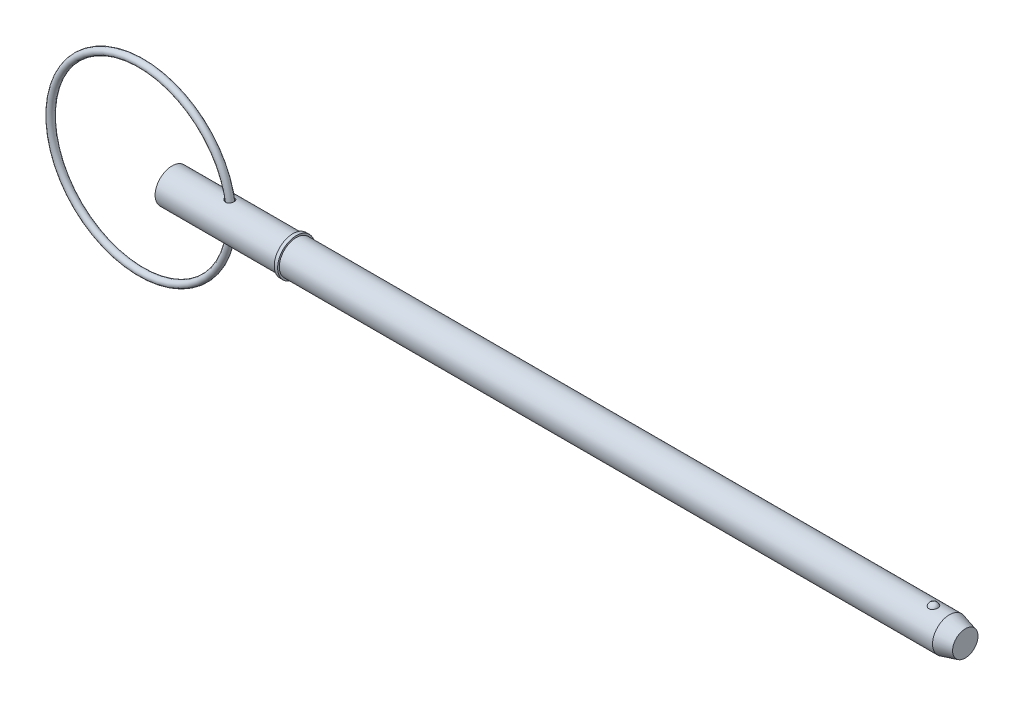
ISO-10303-21;
HEADER;
FILE_DESCRIPTION(('STEP AP214'),'2;1');
FILE_NAME('part.step','',(''),(''),'','','');
FILE_SCHEMA(('AUTOMOTIVE_DESIGN { 1 0 10303 214 1 1 1 1 }'));
ENDSEC;
DATA;
#1=APPLICATION_CONTEXT('core data for automotive mechanical design processes');
#2=APPLICATION_PROTOCOL_DEFINITION('international standard','automotive_design',2000,#1);
#3=PRODUCT_CONTEXT('',#1,'mechanical');
#4=PRODUCT('Part','Part','',(#3));
#5=PRODUCT_RELATED_PRODUCT_CATEGORY('part','',(#4));
#6=PRODUCT_DEFINITION_FORMATION('','',#4);
#7=PRODUCT_DEFINITION_CONTEXT('part definition',#1,'design');
#8=PRODUCT_DEFINITION('design','',#6,#7);
#9=PRODUCT_DEFINITION_SHAPE('','',#8);
#10=(LENGTH_UNIT() NAMED_UNIT(*) SI_UNIT(.MILLI.,.METRE.));
#11=(NAMED_UNIT(*) PLANE_ANGLE_UNIT() SI_UNIT($,.RADIAN.));
#12=(NAMED_UNIT(*) SI_UNIT($,.STERADIAN.) SOLID_ANGLE_UNIT());
#13=UNCERTAINTY_MEASURE_WITH_UNIT(LENGTH_MEASURE(1.E-05),#10,'distance_accuracy_value','');
#14=(GEOMETRIC_REPRESENTATION_CONTEXT(3) GLOBAL_UNCERTAINTY_ASSIGNED_CONTEXT((#13)) GLOBAL_UNIT_ASSIGNED_CONTEXT((#10,
#11,#12)) REPRESENTATION_CONTEXT('',''));
#15=CARTESIAN_POINT('',(0.,0.,0.));
#16=DIRECTION('',(0.,0.,1.));
#17=DIRECTION('',(1.,0.,0.));
#18=AXIS2_PLACEMENT_3D('',#15,#16,#17);
#19=CARTESIAN_POINT('',(-4.3552379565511,0.,0.));
#20=DIRECTION('',(0.,0.,1.));
#21=DIRECTION('',(1.,0.,0.));
#22=AXIS2_PLACEMENT_3D('',#19,#20,#21);
#23=TOROIDAL_SURFACE('',#22,12.7,0.476000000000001);
#24=CARTESIAN_POINT('',(8.8207620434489,0.,0.));
#25=VERTEX_POINT('',#24);
#26=VERTEX_LOOP('',#25);
#27=FACE_BOUND('',#26,.T.);
#28=ADVANCED_FACE('P0_F12',(#27),#23,.T.);
#29=CLOSED_SHELL('',(#28));
#30=MANIFOLD_SOLID_BREP('P0_B1',#29);
#31=CARTESIAN_POINT('',(0.,0.,0.));
#32=DIRECTION('',(1.,0.,0.));
#33=DIRECTION('',(0.,0.,-1.));
#34=AXIS2_PLACEMENT_3D('',#31,#32,#33);
#35=CYLINDRICAL_SURFACE('',#34,2.38);
#36=CARTESIAN_POINT('',(7.65248265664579,2.35074198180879,-0.372037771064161));
#37=CARTESIAN_POINT('',(7.67546616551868,2.34644965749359,-0.399158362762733));
#38=CARTESIAN_POINT('',(7.70081651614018,2.34199234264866,-0.424274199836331));
#39=CARTESIAN_POINT('',(7.75542747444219,2.33326580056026,-0.46990771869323));
#40=CARTESIAN_POINT('',(7.78469342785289,2.32899684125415,-0.49041900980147));
#41=CARTESIAN_POINT('',(7.8462833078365,2.32114904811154,-0.526312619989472));
#42=CARTESIAN_POINT('',(7.87860537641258,2.31756979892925,-0.541698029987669));
#43=CARTESIAN_POINT('',(7.9454452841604,2.31153734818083,-0.566889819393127));
#44=CARTESIAN_POINT('',(7.97996214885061,2.30908365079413,-0.576698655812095));
#45=CARTESIAN_POINT('',(8.05000735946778,2.30564492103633,-0.590297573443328));
#46=CARTESIAN_POINT('',(8.0855275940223,2.30465036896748,-0.594126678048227));
#47=CARTESIAN_POINT('',(8.15670718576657,2.30426876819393,-0.595606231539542));
#48=CARTESIAN_POINT('',(8.1923664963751,2.30488122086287,-0.593258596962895));
#49=CARTESIAN_POINT('',(8.26077822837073,2.30759475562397,-0.582609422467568));
#50=CARTESIAN_POINT('',(8.29358437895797,2.30961492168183,-0.574631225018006));
#51=CARTESIAN_POINT('',(8.35727060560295,2.31483318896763,-0.553233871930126));
#52=CARTESIAN_POINT('',(8.38815097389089,2.31803111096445,-0.53981554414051));
#53=CARTESIAN_POINT('',(8.44618254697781,2.3251225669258,-0.508384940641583));
#54=CARTESIAN_POINT('',(8.47341743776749,2.32899254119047,-0.490521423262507));
#55=CARTESIAN_POINT('',(8.5244826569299,2.33706025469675,-0.450515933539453));
#56=CARTESIAN_POINT('',(8.54831285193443,2.34125800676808,-0.428373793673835));
#57=CARTESIAN_POINT('',(8.5921621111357,2.34956202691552,-0.38020980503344));
#58=CARTESIAN_POINT('',(8.61214543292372,2.35366715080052,-0.354155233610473));
#59=CARTESIAN_POINT('',(8.64754725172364,2.36130301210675,-0.299034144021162));
#60=CARTESIAN_POINT('',(8.66296545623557,2.36483371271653,-0.269967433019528));
#61=CARTESIAN_POINT('',(8.68903776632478,2.37098548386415,-0.209215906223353));
#62=CARTESIAN_POINT('',(8.69962580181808,2.37359383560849,-0.177501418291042));
#63=CARTESIAN_POINT('',(8.71546966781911,2.37755210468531,-0.112692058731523));
#64=CARTESIAN_POINT('',(8.72072552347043,2.37890202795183,-0.0795971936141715));
#65=CARTESIAN_POINT('',(8.72577448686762,2.38019811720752,-0.0129544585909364));
#66=CARTESIAN_POINT('',(8.72556573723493,2.38014380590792,0.0205935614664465));
#67=CARTESIAN_POINT('',(8.71968604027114,2.37863606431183,0.0871753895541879));
#68=CARTESIAN_POINT('',(8.71401506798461,2.37718262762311,0.120209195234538));
#69=CARTESIAN_POINT('',(8.69736472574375,2.37303648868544,0.184779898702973));
#70=CARTESIAN_POINT('',(8.68639268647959,2.37034549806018,0.216318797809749));
#71=CARTESIAN_POINT('',(8.65941400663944,2.36401552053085,0.277063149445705));
#72=CARTESIAN_POINT('',(8.6434071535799,2.36037649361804,0.306268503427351));
#73=CARTESIAN_POINT('',(8.60670627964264,2.35253749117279,0.361595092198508));
#74=CARTESIAN_POINT('',(8.58600040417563,2.34833610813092,0.387708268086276));
#75=CARTESIAN_POINT('',(8.54044852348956,2.33984863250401,0.436017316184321));
#76=CARTESIAN_POINT('',(8.51560272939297,2.33556254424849,0.458213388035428));
#77=CARTESIAN_POINT('',(8.46260111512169,2.32742099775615,0.497916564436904));
#78=CARTESIAN_POINT('',(8.43446763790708,2.32356294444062,0.51545294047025));
#79=CARTESIAN_POINT('',(8.37555109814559,2.31668866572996,0.545520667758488));
#80=CARTESIAN_POINT('',(8.34476845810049,2.31367230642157,0.558052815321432));
#81=CARTESIAN_POINT('',(8.28194930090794,2.30886128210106,0.57763341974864));
#82=CARTESIAN_POINT('',(8.24993988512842,2.30704826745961,0.584764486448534));
#83=CARTESIAN_POINT('',(8.18514558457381,2.30475365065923,0.593744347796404));
#84=CARTESIAN_POINT('',(8.15236068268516,2.30427207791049,0.595593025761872));
#85=CARTESIAN_POINT('',(8.08670515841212,2.30466513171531,0.594069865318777));
#86=CARTESIAN_POINT('',(8.05383545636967,2.30554895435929,0.590662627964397));
#87=CARTESIAN_POINT('',(7.98908593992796,2.30856010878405,0.578780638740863));
#88=CARTESIAN_POINT('',(7.95720636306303,2.31068773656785,0.570304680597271));
#89=CARTESIAN_POINT('',(7.89377258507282,2.31605973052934,0.54809064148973));
#90=CARTESIAN_POINT('',(7.86230095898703,2.31935100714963,0.534128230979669));
#91=CARTESIAN_POINT('',(7.80205133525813,2.32664713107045,0.501391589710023));
#92=CARTESIAN_POINT('',(7.77327429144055,2.33065222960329,0.48261566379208));
#93=CARTESIAN_POINT('',(7.7179634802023,2.3391254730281,0.439760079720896));
#94=CARTESIAN_POINT('',(7.69158313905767,2.3436062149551,0.415484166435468));
#95=CARTESIAN_POINT('',(7.64339516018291,2.35235146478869,0.362706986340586));
#96=CARTESIAN_POINT('',(7.62158727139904,2.35661598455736,0.334205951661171));
#97=CARTESIAN_POINT('',(7.58382605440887,2.36432007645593,0.274368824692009));
#98=CARTESIAN_POINT('',(7.56774982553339,2.36777633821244,0.243112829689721));
#99=CARTESIAN_POINT('',(7.54152169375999,2.3735493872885,0.178112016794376));
#100=CARTESIAN_POINT('',(7.53136536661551,2.3758670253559,0.14436907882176));
#101=CARTESIAN_POINT('',(7.51809691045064,2.37891982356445,0.0783638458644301));
#102=CARTESIAN_POINT('',(7.5144720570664,2.37976992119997,0.0462095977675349));
#103=CARTESIAN_POINT('',(7.51285288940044,2.38014795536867,-0.0182487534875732));
#104=CARTESIAN_POINT('',(7.5148575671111,2.37967612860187,-0.0505528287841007));
#105=CARTESIAN_POINT('',(7.52413867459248,2.37752661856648,-0.112617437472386));
#106=CARTESIAN_POINT('',(7.53113538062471,2.37591295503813,-0.14242285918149));
#107=CARTESIAN_POINT('',(7.5497775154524,2.37172196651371,-0.200451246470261));
#108=CARTESIAN_POINT('',(7.56142049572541,2.3691451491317,-0.228675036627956));
#109=CARTESIAN_POINT('',(7.58571901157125,2.36396321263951,-0.276620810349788));
#110=CARTESIAN_POINT('',(7.59751818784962,2.36150235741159,-0.296799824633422));
#111=CARTESIAN_POINT('',(7.62336661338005,2.35629864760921,-0.33561908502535));
#112=CARTESIAN_POINT('',(7.63741608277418,2.353555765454,-0.354259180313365));
#113=CARTESIAN_POINT('',(7.65248265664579,2.35074198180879,-0.372037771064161));
#114=B_SPLINE_CURVE_WITH_KNOTS('',3,(#36,#37,#38,#39,#40,#41,#42,#43,#44,#45,#46,#47,#48,#49,
#50,#51,#52,#53,#54,#55,#56,#57,#58,#59,#60,#61,#62,#63,#64,#65,#66,#67,#68,#69,#70,#71,#72,#73,
#74,#75,#76,#77,#78,#79,#80,#81,#82,#83,#84,#85,#86,#87,#88,#89,#90,#91,#92,#93,#94,#95,#96,#97,
#98,#99,#100,#101,#102,#103,#104,#105,#106,#107,#108,#109,#110,#111,#112,#113),.UNSPECIFIED.,
.T.,.F.,(4,2,2,2,2,2,2,2,2,2,2,2,2,2,2,2,2,2,2,2,2,2,2,2,2,2,2,2,2,2,2,2,2,2,2,2,2,2,4),(0.,
0.107335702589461,0.214819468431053,0.322238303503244,0.429609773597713,0.536277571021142,
0.642912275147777,0.743874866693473,0.844822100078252,0.942762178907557,1.04070609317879,
1.1395202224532,1.23834068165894,1.33847507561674,1.43860899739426,1.53877695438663,
1.63894536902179,1.73897565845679,1.83901017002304,1.93929990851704,2.03958453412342,
2.13922343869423,2.23884648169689,2.33691317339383,2.4349820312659,2.53371427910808,
2.63247003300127,2.73577311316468,2.83911262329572,2.94697761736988,3.05483668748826,
3.16021984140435,3.26552413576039,3.36212700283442,3.45871257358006,3.55027266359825,
3.64178456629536,3.71214035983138,3.78250304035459),.UNSPECIFIED.);
#115=CARTESIAN_POINT('',(7.65248265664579,2.35074198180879,-0.372037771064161));
#116=VERTEX_POINT('',#115);
#117=EDGE_CURVE('P1_E42',#116,#116,#114,.T.);
#118=ORIENTED_EDGE('',*,*,#117,.T.);
#119=EDGE_LOOP('',(#118));
#120=FACE_BOUND('',#119,.T.);
#121=CARTESIAN_POINT('',(0.,0.,0.));
#122=DIRECTION('',(1.,0.,0.));
#123=DIRECTION('',(0.,0.,-1.));
#124=AXIS2_PLACEMENT_3D('',#121,#122,#123);
#125=CIRCLE('',#124,2.38);
#126=CARTESIAN_POINT('',(0.,0.,-2.38));
#127=VERTEX_POINT('',#126);
#128=EDGE_CURVE('P1_E9',#127,#127,#125,.T.);
#129=ORIENTED_EDGE('',*,*,#128,.T.);
#130=EDGE_LOOP('',(#129));
#131=FACE_BOUND('',#130,.T.);
#132=CARTESIAN_POINT('',(16.974,0.,0.));
#133=DIRECTION('',(1.,0.,0.));
#134=DIRECTION('',(0.,0.,-1.));
#135=AXIS2_PLACEMENT_3D('',#132,#133,#134);
#136=CIRCLE('',#135,2.38);
#137=CARTESIAN_POINT('',(16.974,0.,-2.38));
#138=VERTEX_POINT('',#137);
#139=EDGE_CURVE('P1_E25',#138,#138,#136,.T.);
#140=ORIENTED_EDGE('',*,*,#139,.F.);
#141=EDGE_LOOP('',(#140));
#142=FACE_BOUND('',#141,.T.);
#143=CARTESIAN_POINT('',(7.65248265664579,-2.35074198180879,-0.372037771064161));
#144=CARTESIAN_POINT('',(7.63152023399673,-2.35465684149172,-0.347300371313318));
#145=CARTESIAN_POINT('',(7.61251328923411,-2.35843676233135,-0.320880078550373));
#146=CARTESIAN_POINT('',(7.57904107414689,-2.36534227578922,-0.265218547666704));
#147=CARTESIAN_POINT('',(7.56457485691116,-2.36846800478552,-0.235977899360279));
#148=CARTESIAN_POINT('',(7.54072865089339,-2.37373250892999,-0.175281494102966));
#149=CARTESIAN_POINT('',(7.53136565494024,-2.37586798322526,-0.143818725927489));
#150=CARTESIAN_POINT('',(7.51825775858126,-2.37888184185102,-0.0796854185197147));
#151=CARTESIAN_POINT('',(7.51451093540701,-2.37976065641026,-0.0470152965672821));
#152=CARTESIAN_POINT('',(7.51287230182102,-2.38014359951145,0.0167788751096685));
#153=CARTESIAN_POINT('',(7.51468714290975,-2.37971660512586,0.0478953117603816));
#154=CARTESIAN_POINT('',(7.52344977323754,-2.37768530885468,0.109352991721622));
#155=CARTESIAN_POINT('',(7.53039746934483,-2.37608102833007,0.139694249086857));
#156=CARTESIAN_POINT('',(7.54900783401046,-2.37189301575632,0.198451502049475));
#157=CARTESIAN_POINT('',(7.56061918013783,-2.36931996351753,0.226884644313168));
#158=CARTESIAN_POINT('',(7.58810377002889,-2.36345094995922,0.281524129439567));
#159=CARTESIAN_POINT('',(7.60397804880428,-2.36015481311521,0.307729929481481));
#160=CARTESIAN_POINT('',(7.64062367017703,-2.35291979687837,0.359001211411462));
#161=CARTESIAN_POINT('',(7.66164499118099,-2.34895316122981,0.383883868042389));
#162=CARTESIAN_POINT('',(7.70730875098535,-2.34094029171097,0.430056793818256));
#163=CARTESIAN_POINT('',(7.73195270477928,-2.33689402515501,0.451345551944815));
#164=CARTESIAN_POINT('',(7.78628123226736,-2.32880869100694,0.491427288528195));
#165=CARTESIAN_POINT('',(7.81620889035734,-2.32479472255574,0.509896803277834));
#166=CARTESIAN_POINT('',(7.87876464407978,-2.31758417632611,0.541729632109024));
#167=CARTESIAN_POINT('',(7.91139323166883,-2.31438774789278,0.55509201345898));
#168=CARTESIAN_POINT('',(7.97916670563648,-2.30915137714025,0.576493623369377));
#169=CARTESIAN_POINT('',(8.0143485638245,-2.30713552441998,0.584422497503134));
#170=CARTESIAN_POINT('',(8.08560438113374,-2.30465258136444,0.594140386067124));
#171=CARTESIAN_POINT('',(8.12167802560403,-2.30418495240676,0.595931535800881));
#172=CARTESIAN_POINT('',(8.19193481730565,-2.30488473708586,0.59321801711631));
#173=CARTESIAN_POINT('',(8.2261295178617,-2.30597897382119,0.588995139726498));
#174=CARTESIAN_POINT('',(8.29321509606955,-2.30956729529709,0.574762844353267));
#175=CARTESIAN_POINT('',(8.32610629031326,-2.31206103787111,0.564754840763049));
#176=CARTESIAN_POINT('',(8.38816900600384,-2.31802118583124,0.539753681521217));
#177=CARTESIAN_POINT('',(8.41743993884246,-2.32144077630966,0.52499526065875));
#178=CARTESIAN_POINT('',(8.47302365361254,-2.32890801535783,0.490807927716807));
#179=CARTESIAN_POINT('',(8.49933643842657,-2.33295566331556,0.471379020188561));
#180=CARTESIAN_POINT('',(8.54827790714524,-2.3412242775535,0.428422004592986));
#181=CARTESIAN_POINT('',(8.57091094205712,-2.34544503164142,0.40489880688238));
#182=CARTESIAN_POINT('',(8.61197038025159,-2.35360640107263,0.354387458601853));
#183=CARTESIAN_POINT('',(8.63039647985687,-2.35754699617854,0.32739905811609));
#184=CARTESIAN_POINT('',(8.66284943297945,-2.36478461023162,0.270249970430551));
#185=CARTESIAN_POINT('',(8.67680333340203,-2.36807065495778,0.240046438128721));
#186=CARTESIAN_POINT('',(8.69957181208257,-2.37356560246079,0.177668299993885));
#187=CARTESIAN_POINT('',(8.70838630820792,-2.37577448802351,0.14549366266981));
#188=CARTESIAN_POINT('',(8.72068442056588,-2.37888446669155,0.0799353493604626));
#189=CARTESIAN_POINT('',(8.72414498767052,-2.37977990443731,0.046547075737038));
#190=CARTESIAN_POINT('',(8.72557509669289,-2.38014803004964,-0.0203543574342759));
#191=CARTESIAN_POINT('',(8.72354468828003,-2.37962073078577,-0.0538675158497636));
#192=CARTESIAN_POINT('',(8.71405606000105,-2.37720346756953,-0.119981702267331));
#193=CARTESIAN_POINT('',(8.70661109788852,-2.37531683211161,-0.152584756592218));
#194=CARTESIAN_POINT('',(8.68649336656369,-2.37038779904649,-0.216044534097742));
#195=CARTESIAN_POINT('',(8.67382040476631,-2.36734535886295,-0.24690119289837));
#196=CARTESIAN_POINT('',(8.64352750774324,-2.36042700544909,-0.306062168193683));
#197=CARTESIAN_POINT('',(8.62589743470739,-2.35654938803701,-0.334361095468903));
#198=CARTESIAN_POINT('',(8.58613860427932,-2.34839114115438,-0.387535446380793));
#199=CARTESIAN_POINT('',(8.5640098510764,-2.34411051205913,-0.412410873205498));
#200=CARTESIAN_POINT('',(8.51586484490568,-2.33563475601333,-0.457982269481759));
#201=CARTESIAN_POINT('',(8.48985596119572,-2.33143948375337,-0.478685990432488));
#202=CARTESIAN_POINT('',(8.43462330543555,-2.32360655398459,-0.515369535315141));
#203=CARTESIAN_POINT('',(8.40540000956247,-2.31996881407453,-0.531350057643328));
#204=CARTESIAN_POINT('',(8.34502624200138,-2.31371771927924,-0.557938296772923));
#205=CARTESIAN_POINT('',(8.31391082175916,-2.31108995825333,-0.568622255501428));
#206=CARTESIAN_POINT('',(8.25027207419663,-2.30707117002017,-0.584715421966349));
#207=CARTESIAN_POINT('',(8.21774884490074,-2.30568005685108,-0.590124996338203));
#208=CARTESIAN_POINT('',(8.15238918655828,-2.30427145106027,-0.595601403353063));
#209=CARTESIAN_POINT('',(8.11955499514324,-2.3042474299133,-0.595693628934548));
#210=CARTESIAN_POINT('',(8.05430726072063,-2.30552664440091,-0.590722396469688));
#211=CARTESIAN_POINT('',(8.02189380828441,-2.3068301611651,-0.585657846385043));
#212=CARTESIAN_POINT('',(7.95720150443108,-2.31066076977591,-0.570360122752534));
#213=CARTESIAN_POINT('',(7.92496602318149,-2.31322859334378,-0.55995436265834));
#214=CARTESIAN_POINT('',(7.86260707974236,-2.31930140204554,-0.534242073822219));
#215=CARTESIAN_POINT('',(7.83248403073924,-2.32280656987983,-0.518934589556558));
#216=CARTESIAN_POINT('',(7.77533132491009,-2.33034138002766,-0.483968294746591));
#217=CARTESIAN_POINT('',(7.74827623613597,-2.33436601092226,-0.464349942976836));
#218=CARTESIAN_POINT('',(7.69762060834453,-2.34255524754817,-0.4210920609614));
#219=CARTESIAN_POINT('',(7.67401956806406,-2.34671983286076,-0.397453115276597));
#220=CARTESIAN_POINT('',(7.65248265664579,-2.35074198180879,-0.372037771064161));
#221=B_SPLINE_CURVE_WITH_KNOTS('',3,(#143,#144,#145,#146,#147,#148,#149,#150,#151,#152,#153,
#154,#155,#156,#157,#158,#159,#160,#161,#162,#163,#164,#165,#166,#167,#168,#169,#170,#171,#172,
#173,#174,#175,#176,#177,#178,#179,#180,#181,#182,#183,#184,#185,#186,#187,#188,#189,#190,#191,
#192,#193,#194,#195,#196,#197,#198,#199,#200,#201,#202,#203,#204,#205,#206,#207,#208,#209,#210,
#211,#212,#213,#214,#215,#216,#217,#218,#219,#220),.UNSPECIFIED.,.T.,.F.,(4,2,2,2,2,2,2,2,2,2,2,
2,2,2,2,2,2,2,2,2,2,2,2,2,2,2,2,2,2,2,2,2,2,2,2,2,2,2,4),(0.,0.0978755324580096,
0.19573064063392,0.293909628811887,0.39205499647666,0.48511441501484,0.578172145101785,
0.670232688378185,0.762315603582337,0.860342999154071,0.958411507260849,1.06411708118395,
1.16984195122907,1.27765506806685,1.38543067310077,1.48831936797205,1.59118291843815,
1.68959047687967,1.78799793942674,1.88628818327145,1.98458551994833,2.08441314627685,
2.18424236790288,2.28450017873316,2.38475708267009,2.48476932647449,2.58478525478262,
2.68500723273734,2.78522911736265,2.88526302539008,2.98528213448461,3.08381637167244,
3.18234375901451,3.28040059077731,3.37847819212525,3.4799455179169,3.58143263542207,
3.68200512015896,3.78256299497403),.UNSPECIFIED.);
#222=CARTESIAN_POINT('',(7.65248265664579,-2.35074198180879,-0.372037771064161));
#223=VERTEX_POINT('',#222);
#224=EDGE_CURVE('P1_E17',#223,#223,#221,.T.);
#225=ORIENTED_EDGE('',*,*,#224,.T.);
#226=EDGE_LOOP('',(#225));
#227=FACE_BOUND('',#226,.T.);
#228=ADVANCED_FACE('P1_F13',(#120,#131,#142,#227),#35,.T.);
#229=CARTESIAN_POINT('',(0.,0.,0.));
#230=DIRECTION('',(1.,0.,0.));
#231=DIRECTION('',(0.,0.,-1.));
#232=AXIS2_PLACEMENT_3D('',#229,#230,#231);
#233=CYLINDRICAL_SURFACE('',#232,2.38);
#234=CARTESIAN_POINT('',(109.209429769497,0.,0.));
#235=DIRECTION('',(1.,0.,0.));
#236=DIRECTION('',(0.,0.,-1.));
#237=AXIS2_PLACEMENT_3D('',#234,#235,#236);
#238=CIRCLE('',#237,2.38);
#239=CARTESIAN_POINT('',(109.209429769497,0.,-2.38));
#240=VERTEX_POINT('',#239);
#241=EDGE_CURVE('P1_E99',#240,#240,#238,.T.);
#242=ORIENTED_EDGE('',*,*,#241,.F.);
#243=EDGE_LOOP('',(#242));
#244=FACE_BOUND('',#243,.T.);
#245=CARTESIAN_POINT('',(17.45,0.,0.));
#246=DIRECTION('',(1.,0.,0.));
#247=DIRECTION('',(0.,0.,-1.));
#248=AXIS2_PLACEMENT_3D('',#245,#246,#247);
#249=CIRCLE('',#248,2.38);
#250=CARTESIAN_POINT('',(17.45,0.,-2.38));
#251=VERTEX_POINT('',#250);
#252=EDGE_CURVE('P1_E96',#251,#251,#249,.T.);
#253=ORIENTED_EDGE('',*,*,#252,.T.);
#254=EDGE_LOOP('',(#253));
#255=FACE_BOUND('',#254,.T.);
#256=CARTESIAN_POINT('',(106.963449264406,2.29215686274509,0.640637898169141));
#257=CARTESIAN_POINT('',(106.930355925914,2.29215737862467,0.640637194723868));
#258=CARTESIAN_POINT('',(106.897254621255,2.29293179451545,0.63788468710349));
#259=CARTESIAN_POINT('',(106.832017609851,2.29594030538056,0.626968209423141));
#260=CARTESIAN_POINT('',(106.799882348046,2.29817506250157,0.6188017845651));
#261=CARTESIAN_POINT('',(106.737540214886,2.30384308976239,0.597351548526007));
#262=CARTESIAN_POINT('',(106.70733051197,2.30727454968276,0.584075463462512));
#263=CARTESIAN_POINT('',(106.649567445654,2.31495941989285,0.552829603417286));
#264=CARTESIAN_POINT('',(106.62201418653,2.31921286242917,0.534859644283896));
#265=CARTESIAN_POINT('',(106.569593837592,2.3282021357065,0.494282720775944));
#266=CARTESIAN_POINT('',(106.544805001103,2.33294694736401,0.471576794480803));
#267=CARTESIAN_POINT('',(106.499216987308,2.34234144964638,0.422446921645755));
#268=CARTESIAN_POINT('',(106.478418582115,2.34699112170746,0.396022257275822));
#269=CARTESIAN_POINT('',(106.44035804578,2.3559394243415,0.338855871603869));
#270=CARTESIAN_POINT('',(106.423305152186,2.36021170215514,0.307970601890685));
#271=CARTESIAN_POINT('',(106.3943607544,2.3677057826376,0.243750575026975));
#272=CARTESIAN_POINT('',(106.3824701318,2.37092740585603,0.210415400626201));
#273=CARTESIAN_POINT('',(106.363807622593,2.37606901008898,0.14118943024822));
#274=CARTESIAN_POINT('',(106.357195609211,2.37794816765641,0.105252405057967));
#275=CARTESIAN_POINT('',(106.349809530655,2.38005135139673,0.0327351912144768));
#276=CARTESIAN_POINT('',(106.349035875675,2.38027526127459,-0.00384504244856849));
#277=CARTESIAN_POINT('',(106.353362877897,2.37903842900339,-0.0769838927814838));
#278=CARTESIAN_POINT('',(106.35852028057,2.37756141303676,-0.113538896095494));
#279=CARTESIAN_POINT('',(106.374701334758,2.37305303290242,-0.185229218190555));
#280=CARTESIAN_POINT('',(106.385725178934,2.37002161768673,-0.220364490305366));
#281=CARTESIAN_POINT('',(106.413397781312,2.36273722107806,-0.28815667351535));
#282=CARTESIAN_POINT('',(106.430038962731,2.35848588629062,-0.320816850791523));
#283=CARTESIAN_POINT('',(106.468598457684,2.34923130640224,-0.382744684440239));
#284=CARTESIAN_POINT('',(106.490516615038,2.34422808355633,-0.412012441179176));
#285=CARTESIAN_POINT('',(106.538754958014,2.33412555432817,-0.465830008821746));
#286=CARTESIAN_POINT('',(106.565002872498,2.32902887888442,-0.490444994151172));
#287=CARTESIAN_POINT('',(106.621476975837,2.31926941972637,-0.534700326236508));
#288=CARTESIAN_POINT('',(106.651702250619,2.3146065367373,-0.554341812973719));
#289=CARTESIAN_POINT('',(106.714061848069,2.30645675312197,-0.587312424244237));
#290=CARTESIAN_POINT('',(106.746078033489,2.30293152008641,-0.600855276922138));
#291=CARTESIAN_POINT('',(106.812079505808,2.29725171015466,-0.622220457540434));
#292=CARTESIAN_POINT('',(106.846064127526,2.29509667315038,-0.630044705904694));
#293=CARTESIAN_POINT('',(106.913299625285,2.29249264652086,-0.639452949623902));
#294=CARTESIAN_POINT('',(106.946508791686,2.2919675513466,-0.641315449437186));
#295=CARTESIAN_POINT('',(107.012763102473,2.2924684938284,-0.6395226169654));
#296=CARTESIAN_POINT('',(107.045808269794,2.29349430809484,-0.635868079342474));
#297=CARTESIAN_POINT('',(107.110102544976,2.29694059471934,-0.623301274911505));
#298=CARTESIAN_POINT('',(107.141374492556,2.29933234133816,-0.614497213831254));
#299=CARTESIAN_POINT('',(107.201995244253,2.30522511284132,-0.592006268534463));
#300=CARTESIAN_POINT('',(107.231343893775,2.30872622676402,-0.578318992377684));
#301=CARTESIAN_POINT('',(107.288036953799,2.31655795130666,-0.546112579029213));
#302=CARTESIAN_POINT('',(107.315320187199,2.32090569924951,-0.527490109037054));
#303=CARTESIAN_POINT('',(107.366490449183,2.32992206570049,-0.486117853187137));
#304=CARTESIAN_POINT('',(107.390376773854,2.33459075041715,-0.463367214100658));
#305=CARTESIAN_POINT('',(107.435272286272,2.34399834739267,-0.413220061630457));
#306=CARTESIAN_POINT('',(107.456097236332,2.34873051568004,-0.385657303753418));
#307=CARTESIAN_POINT('',(107.493056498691,2.35754932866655,-0.327455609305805));
#308=CARTESIAN_POINT('',(107.509189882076,2.36163584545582,-0.296816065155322));
#309=CARTESIAN_POINT('',(107.5369822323,2.36889321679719,-0.232047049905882));
#310=CARTESIAN_POINT('',(107.548445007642,2.37202275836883,-0.197828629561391));
#311=CARTESIAN_POINT('',(107.565752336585,2.37681926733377,-0.127900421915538));
#312=CARTESIAN_POINT('',(107.571596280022,2.37848607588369,-0.0921904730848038));
#313=CARTESIAN_POINT('',(107.577605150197,2.38020024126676,-0.0196348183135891));
#314=CARTESIAN_POINT('',(107.57767043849,2.38021918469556,0.0172198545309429));
#315=CARTESIAN_POINT('',(107.571868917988,2.37856356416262,0.0904219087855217));
#316=CARTESIAN_POINT('',(107.566001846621,2.37688892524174,0.126769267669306));
#317=CARTESIAN_POINT('',(107.548425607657,2.37201688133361,0.198028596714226));
#318=CARTESIAN_POINT('',(107.536699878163,2.36881516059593,0.23293619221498));
#319=CARTESIAN_POINT('',(107.50763544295,2.36123444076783,0.300196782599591));
#320=CARTESIAN_POINT('',(107.490296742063,2.3568554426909,0.332549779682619));
#321=CARTESIAN_POINT('',(107.450535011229,2.34744667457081,0.39349541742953));
#322=CARTESIAN_POINT('',(107.428152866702,2.34242227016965,0.422115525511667));
#323=CARTESIAN_POINT('',(107.378739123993,2.33227293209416,0.475004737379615));
#324=CARTESIAN_POINT('',(107.351707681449,2.32714800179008,0.499273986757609));
#325=CARTESIAN_POINT('',(107.294498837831,2.31755359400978,0.542046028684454));
#326=CARTESIAN_POINT('',(107.26442973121,2.31306986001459,0.560690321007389));
#327=CARTESIAN_POINT('',(107.201386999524,2.3051412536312,0.592447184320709));
#328=CARTESIAN_POINT('',(107.168415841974,2.30169550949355,0.605564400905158));
#329=CARTESIAN_POINT('',(107.106842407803,2.29677744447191,0.623927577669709));
#330=CARTESIAN_POINT('',(107.07855556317,2.29505839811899,0.630178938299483));
#331=CARTESIAN_POINT('',(107.021330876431,2.29274795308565,0.638534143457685));
#332=CARTESIAN_POINT('',(106.992393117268,2.29215641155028,0.640638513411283));
#333=CARTESIAN_POINT('',(106.963449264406,2.29215686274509,0.640637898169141));
#334=B_SPLINE_CURVE_WITH_KNOTS('',3,(#256,#257,#258,#259,#260,#261,#262,#263,#264,#265,#266,
#267,#268,#269,#270,#271,#272,#273,#274,#275,#276,#277,#278,#279,#280,#281,#282,#283,#284,#285,
#286,#287,#288,#289,#290,#291,#292,#293,#294,#295,#296,#297,#298,#299,#300,#301,#302,#303,#304,
#305,#306,#307,#308,#309,#310,#311,#312,#313,#314,#315,#316,#317,#318,#319,#320,#321,#322,#323,
#324,#325,#326,#327,#328,#329,#330,#331,#332,#333),.UNSPECIFIED.,.T.,.F.,(4,2,2,2,2,2,2,2,2,2,2,
2,2,2,2,2,2,2,2,2,2,2,2,2,2,2,2,2,2,2,2,2,2,2,2,2,2,2,4),(0.,0.0991724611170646,
0.198389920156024,0.297457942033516,0.396529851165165,0.497927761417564,0.599345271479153,
0.705475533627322,0.811623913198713,0.920876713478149,1.03013718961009,1.14045177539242,
1.25076998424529,1.36093998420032,1.4711067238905,1.57959248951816,1.68805336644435,
1.79234266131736,1.89659691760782,1.99590391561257,2.09519661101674,2.19247425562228,
2.2897597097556,2.38926978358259,2.48880044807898,2.59293588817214,2.69709193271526,
2.80525821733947,2.91343624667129,3.02347917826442,3.13352698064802,3.2438876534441,
3.3542482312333,3.46374443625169,3.57323697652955,3.67968690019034,3.78604717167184,
3.87279565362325,3.95953314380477),.UNSPECIFIED.);
#335=CARTESIAN_POINT('',(106.963449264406,2.29215686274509,0.640637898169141));
#336=VERTEX_POINT('',#335);
#337=EDGE_CURVE('P1_E34',#336,#336,#334,.T.);
#338=ORIENTED_EDGE('',*,*,#337,.T.);
#339=EDGE_LOOP('',(#338));
#340=FACE_BOUND('',#339,.T.);
#341=ADVANCED_FACE('P1_F46',(#244,#255,#340),#233,.T.);
#342=CARTESIAN_POINT('',(0.,0.,0.));
#343=DIRECTION('',(-1.,0.,0.));
#344=DIRECTION('',(0.,0.,1.));
#345=AXIS2_PLACEMENT_3D('',#342,#343,#344);
#346=PLANE('',#345);
#347=ORIENTED_EDGE('',*,*,#128,.F.);
#348=EDGE_LOOP('',(#347));
#349=FACE_BOUND('',#348,.T.);
#350=ADVANCED_FACE('P1_F15',(#349),#346,.T.);
#351=CARTESIAN_POINT('',(16.974,2.38,0.));
#352=DIRECTION('',(-1.,0.,0.));
#353=DIRECTION('',(0.,0.,1.));
#354=AXIS2_PLACEMENT_3D('',#351,#352,#353);
#355=PLANE('',#354);
#356=ORIENTED_EDGE('',*,*,#139,.T.);
#357=EDGE_LOOP('',(#356));
#358=FACE_BOUND('',#357,.T.);
#359=CARTESIAN_POINT('',(16.974,0.,0.));
#360=DIRECTION('',(1.,0.,0.));
#361=DIRECTION('',(0.,0.,-1.));
#362=AXIS2_PLACEMENT_3D('',#359,#360,#361);
#363=CIRCLE('',#362,2.618);
#364=CARTESIAN_POINT('',(16.974,0.,-2.618));
#365=VERTEX_POINT('',#364);
#366=EDGE_CURVE('P1_E30',#365,#365,#363,.T.);
#367=ORIENTED_EDGE('',*,*,#366,.F.);
#368=EDGE_LOOP('',(#367));
#369=FACE_BOUND('',#368,.T.);
#370=ADVANCED_FACE('P1_F81',(#358,#369),#355,.T.);
#371=CARTESIAN_POINT('',(0.,0.,0.));
#372=DIRECTION('',(1.,0.,0.));
#373=DIRECTION('',(0.,0.,-1.));
#374=AXIS2_PLACEMENT_3D('',#371,#372,#373);
#375=CYLINDRICAL_SURFACE('',#374,2.618);
#376=ORIENTED_EDGE('',*,*,#366,.T.);
#377=EDGE_LOOP('',(#376));
#378=FACE_BOUND('',#377,.T.);
#379=CARTESIAN_POINT('',(17.45,0.,0.));
#380=DIRECTION('',(1.,0.,0.));
#381=DIRECTION('',(0.,0.,-1.));
#382=AXIS2_PLACEMENT_3D('',#379,#380,#381);
#383=CIRCLE('',#382,2.618);
#384=CARTESIAN_POINT('',(17.45,0.,-2.618));
#385=VERTEX_POINT('',#384);
#386=EDGE_CURVE('P1_E95',#385,#385,#383,.T.);
#387=ORIENTED_EDGE('',*,*,#386,.F.);
#388=EDGE_LOOP('',(#387));
#389=FACE_BOUND('',#388,.T.);
#390=ADVANCED_FACE('P1_F68',(#378,#389),#375,.T.);
#391=CARTESIAN_POINT('',(17.45,2.618,0.));
#392=DIRECTION('',(1.,0.,0.));
#393=DIRECTION('',(0.,0.,-1.));
#394=AXIS2_PLACEMENT_3D('',#391,#392,#393);
#395=PLANE('',#394);
#396=ORIENTED_EDGE('',*,*,#386,.T.);
#397=EDGE_LOOP('',(#396));
#398=FACE_BOUND('',#397,.T.);
#399=ORIENTED_EDGE('',*,*,#252,.F.);
#400=EDGE_LOOP('',(#399));
#401=FACE_BOUND('',#400,.T.);
#402=ADVANCED_FACE('P1_F62',(#398,#401),#395,.T.);
#403=CARTESIAN_POINT('',(111.43,0.,0.));
#404=DIRECTION('',(-1.,0.,0.));
#405=DIRECTION('',(0.,0.,1.));
#406=AXIS2_PLACEMENT_3D('',#403,#404,#405);
#407=CONICAL_SURFACE('',#406,1.78500000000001,0.26179938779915);
#408=ORIENTED_EDGE('',*,*,#241,.T.);
#409=EDGE_LOOP('',(#408));
#410=FACE_BOUND('',#409,.T.);
#411=CARTESIAN_POINT('',(111.43,0.,0.));
#412=DIRECTION('',(1.,0.,0.));
#413=DIRECTION('',(0.,0.,-1.));
#414=AXIS2_PLACEMENT_3D('',#411,#412,#413);
#415=CIRCLE('',#414,1.78500000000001);
#416=CARTESIAN_POINT('',(111.43,0.,-1.78500000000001));
#417=VERTEX_POINT('',#416);
#418=EDGE_CURVE('P1_E41',#417,#417,#415,.T.);
#419=ORIENTED_EDGE('',*,*,#418,.F.);
#420=EDGE_LOOP('',(#419));
#421=FACE_BOUND('',#420,.T.);
#422=ADVANCED_FACE('P1_F59',(#410,#421),#407,.T.);
#423=CARTESIAN_POINT('',(111.43,1.78500000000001,0.));
#424=DIRECTION('',(1.,0.,0.));
#425=DIRECTION('',(0.,0.,-1.));
#426=AXIS2_PLACEMENT_3D('',#423,#424,#425);
#427=PLANE('',#426);
#428=ORIENTED_EDGE('',*,*,#418,.T.);
#429=EDGE_LOOP('',(#428));
#430=FACE_BOUND('',#429,.T.);
#431=ADVANCED_FACE('P1_F55',(#430),#427,.T.);
#432=CARTESIAN_POINT('',(106.963449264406,2.14199999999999,0.));
#433=DIRECTION('',(-1.,0.,0.));
#434=DIRECTION('',(0.,-1.,0.));
#435=AXIS2_PLACEMENT_3D('',#432,#433,#434);
#436=SPHERICAL_SURFACE('',#435,0.65800000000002);
#437=ORIENTED_EDGE('',*,*,#337,.F.);
#438=EDGE_LOOP('',(#437));
#439=FACE_BOUND('',#438,.T.);
#440=ADVANCED_FACE('P1_F50',(#439),#436,.T.);
#441=CARTESIAN_POINT('',(-4.3552379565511,0.,0.));
#442=DIRECTION('',(0.,0.,1.));
#443=DIRECTION('',(1.,0.,0.));
#444=AXIS2_PLACEMENT_3D('',#441,#442,#443);
#445=TOROIDAL_SURFACE('',#444,12.7,0.594999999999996);
#446=ORIENTED_EDGE('',*,*,#224,.F.);
#447=EDGE_LOOP('',(#446));
#448=FACE_BOUND('',#447,.T.);
#449=ORIENTED_EDGE('',*,*,#117,.F.);
#450=EDGE_LOOP('',(#449));
#451=FACE_BOUND('',#450,.T.);
#452=ADVANCED_FACE('P1_F54',(#448,#451),#445,.F.);
#453=CLOSED_SHELL('',(#228,#341,#350,#370,#390,#402,#422,#431,#440,#452));
#454=MANIFOLD_SOLID_BREP('P1_B1',#453);
#455=ADVANCED_BREP_SHAPE_REPRESENTATION('',(#18,#30,#454),#14);
#456=SHAPE_DEFINITION_REPRESENTATION(#9,#455);
ENDSEC;
END-ISO-10303-21;
